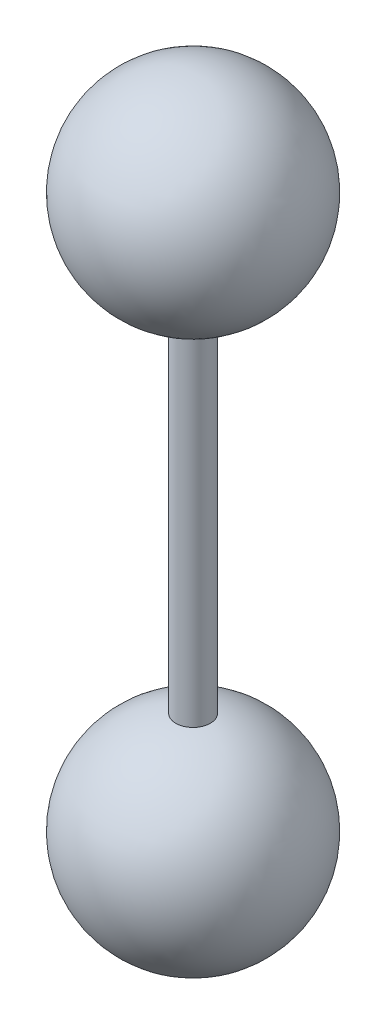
ISO-10303-21;
HEADER;
FILE_DESCRIPTION(('STEP AP214'),'2;1');
FILE_NAME('part.step','',(''),(''),'','','');
FILE_SCHEMA(('AUTOMOTIVE_DESIGN { 1 0 10303 214 1 1 1 1 }'));
ENDSEC;
DATA;
#1=APPLICATION_CONTEXT('core data for automotive mechanical design processes');
#2=APPLICATION_PROTOCOL_DEFINITION('international standard','automotive_design',2000,#1);
#3=PRODUCT_CONTEXT('',#1,'mechanical');
#4=PRODUCT('Part','Part','',(#3));
#5=PRODUCT_RELATED_PRODUCT_CATEGORY('part','',(#4));
#6=PRODUCT_DEFINITION_FORMATION('','',#4);
#7=PRODUCT_DEFINITION_CONTEXT('part definition',#1,'design');
#8=PRODUCT_DEFINITION('design','',#6,#7);
#9=PRODUCT_DEFINITION_SHAPE('','',#8);
#10=(LENGTH_UNIT() NAMED_UNIT(*) SI_UNIT(.MILLI.,.METRE.));
#11=(NAMED_UNIT(*) PLANE_ANGLE_UNIT() SI_UNIT($,.RADIAN.));
#12=(NAMED_UNIT(*) SI_UNIT($,.STERADIAN.) SOLID_ANGLE_UNIT());
#13=UNCERTAINTY_MEASURE_WITH_UNIT(LENGTH_MEASURE(1.E-05),#10,'distance_accuracy_value','');
#14=(GEOMETRIC_REPRESENTATION_CONTEXT(3) GLOBAL_UNCERTAINTY_ASSIGNED_CONTEXT((#13)) GLOBAL_UNIT_ASSIGNED_CONTEXT((#10,
#11,#12)) REPRESENTATION_CONTEXT('',''));
#15=CARTESIAN_POINT('',(0.,0.,0.));
#16=DIRECTION('',(0.,0.,1.));
#17=DIRECTION('',(1.,0.,0.));
#18=AXIS2_PLACEMENT_3D('',#15,#16,#17);
#19=CARTESIAN_POINT('',(0.,5.5,0.));
#20=DIRECTION('',(0.,1.,0.));
#21=DIRECTION('',(0.,0.,1.));
#22=AXIS2_PLACEMENT_3D('',#19,#20,#21);
#23=CYLINDRICAL_SURFACE('',#22,0.25);
#24=CARTESIAN_POINT('',(0.,2.5209800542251,0.));
#25=DIRECTION('',(0.,1.,0.));
#26=DIRECTION('',(0.,0.,1.));
#27=AXIS2_PLACEMENT_3D('',#24,#25,#26);
#28=CIRCLE('',#27,0.25);
#29=CARTESIAN_POINT('',(0.,2.5209800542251,0.25));
#30=VERTEX_POINT('',#29);
#31=EDGE_CURVE('E10',#30,#30,#28,.T.);
#32=ORIENTED_EDGE('',*,*,#31,.F.);
#33=EDGE_LOOP('',(#32));
#34=FACE_BOUND('',#33,.T.);
#35=CARTESIAN_POINT('',(0.,-2.5209800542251,0.));
#36=DIRECTION('',(0.,1.,0.));
#37=DIRECTION('',(0.,0.,1.));
#38=AXIS2_PLACEMENT_3D('',#35,#36,#37);
#39=CIRCLE('',#38,0.25);
#40=CARTESIAN_POINT('',(0.,-2.5209800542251,0.25));
#41=VERTEX_POINT('',#40);
#42=EDGE_CURVE('E42',#41,#41,#39,.T.);
#43=ORIENTED_EDGE('',*,*,#42,.T.);
#44=EDGE_LOOP('',(#43));
#45=FACE_BOUND('',#44,.T.);
#46=ADVANCED_FACE('F36',(#34,#45),#23,.T.);
#47=CARTESIAN_POINT('',(0.,4.,0.));
#48=DIRECTION('',(0.,1.,0.));
#49=DIRECTION('',(1.,0.,0.));
#50=AXIS2_PLACEMENT_3D('',#47,#48,#49);
#51=SPHERICAL_SURFACE('',#50,1.5);
#52=ORIENTED_EDGE('',*,*,#31,.T.);
#53=EDGE_LOOP('',(#52));
#54=FACE_BOUND('',#53,.T.);
#55=ADVANCED_FACE('F51',(#54),#51,.T.);
#56=CARTESIAN_POINT('',(0.,-4.,0.));
#57=DIRECTION('',(0.,-1.,0.));
#58=DIRECTION('',(1.,0.,0.));
#59=AXIS2_PLACEMENT_3D('',#56,#57,#58);
#60=SPHERICAL_SURFACE('',#59,1.5);
#61=ORIENTED_EDGE('',*,*,#42,.F.);
#62=EDGE_LOOP('',(#61));
#63=FACE_BOUND('',#62,.T.);
#64=ADVANCED_FACE('F49',(#63),#60,.T.);
#65=CLOSED_SHELL('',(#46,#55,#64));
#66=MANIFOLD_SOLID_BREP('B2',#65);
#67=ADVANCED_BREP_SHAPE_REPRESENTATION('',(#18,#66),#14);
#68=SHAPE_DEFINITION_REPRESENTATION(#9,#67);
ENDSEC;
END-ISO-10303-21;
